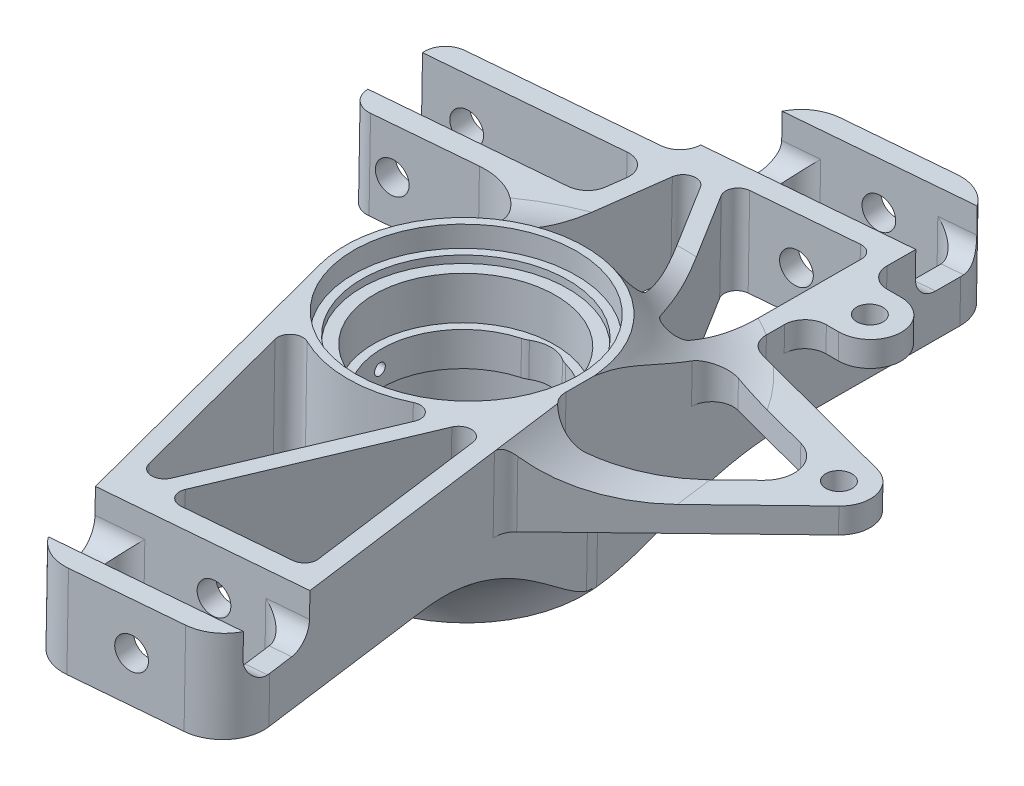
from build123d import *

# Parameters (mm, degrees)
EXTRUDE1_DEPTH               = 41.275
EXTRUDE1_DEPTH_BACK          = 22.224999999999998
SKETCH1_W                    = 279.4
SKETCH1_H                    = 274.177051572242
SKETCH3_R                    = 4.000500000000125
CUT_EXTRUDE1_DEPTH           = 417.6308239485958
CUT_EXTRUDE2_DEPTH           = 417.6308239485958
CUT_EXTRUDE3_DEPTH           = 393.83917714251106
CUT_EXTRUDE4_DEPTH           = 393.83917714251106
CUT_EXTRUDE9_DEPTH           = 393.83917714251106
CUT_EXTRUDE10_REACH          = 680.719
SKETCH13_R                   = 4.762500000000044
CUT_EXTRUDE11_REACH          = 681.051
SKETCH14_R                   = 4.762500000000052
CUT_EXTRUDE12_DEPTH          = 731.3953390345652
CUT_EXTRUDE12_DEPTH_BACK     = 731.3953390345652
CUT_EXTRUDE13_DEPTH          = 731.3953390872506
CUT_EXTRUDE13_DEPTH_BACK     = 731.3953390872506
CUT_EXTRUDE15_DEPTH          = 33.654999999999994
CUT_EXTRUDE16_DEPTH          = 393.8391772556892
SKETCH21_R                   = 4.762500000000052
CUT_EXTRUDE17_DEPTH          = 668.433488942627
CUT_REVOLVE3_ANGLE           = 93.00000000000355
CUT_REVOLVE3_OTHER_WAY_ANGLE = 86.0000000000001
CUT_REVOLVE4_ANGLE           = 95.00000000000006
CUT_REVOLVE4_OTHER_WAY_ANGLE = 87.00000000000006
CUT_EXTRUDE19_DEPTH          = 6.985
CUT_EXTRUDE18_DEPTH          = 388.7974686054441
SKETCH28_R                   = 9.52499999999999
CUT_EXTRUDE20_DEPTH          = 391.6164423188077
FILLET1_R                    = 6.35
SKETCH29_R                   = 1.727199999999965
CUT_EXTRUDE21_DEPTH          = 729.2649900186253


with BuildPart() as part:
    # Sketch1 → Extrude1 (new, two sides: drawn at the far end of the back side and taken through both)
    with BuildSketch(Plane(origin=(0, -592.2859892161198, 10.338390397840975), x_dir=(1, 0, -1.1e-16), z_dir=(0, 0.9998476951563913, -0.017452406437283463)).offset(-EXTRUDE1_DEPTH_BACK)):
        with Locations((12.699999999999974, -244.32882536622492)):
            Rectangle(SKETCH1_W, SKETCH1_H)
    extrude(amount=EXTRUDE1_DEPTH + EXTRUDE1_DEPTH_BACK)

    # Sketch2 → Cut-Revolve1 (revolve, cut)
    with BuildSketch(Plane(origin=(0, 0, 0), x_dir=(0, 0, -1), z_dir=(1, 0, 0)), mode=Mode.PRIVATE) as cut_revolve1_sk:
        Polygon((-219.7355249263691, -560.6866925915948), (-222.27513807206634, -560.642363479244), (-222.3141973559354, -562.8800683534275), (-226.05568242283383, -562.8147604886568), (-226.28259781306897, -575.8147344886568), (-228.8222109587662, -575.7704053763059), (-229.00196550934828, -586.0685366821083), (-226.46235236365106, -586.1128657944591), (-226.68926775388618, -599.112839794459), (-222.94778268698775, -599.1781476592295), (-223.03981526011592, -604.4506902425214), (-220.50020211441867, -604.4950193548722), (-220.6110248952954, -610.8440522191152), (-254.3878797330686, -610.2544750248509), (-253.27965192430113, -546.7641463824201), (-219.50279708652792, -547.3537235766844), align=None)
    revolve(cut_revolve1_sk.sketch.rotate(Axis((0, -489.9527519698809, 252.2880053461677), (0, -0.9998476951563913, 0.01745240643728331)), 180), axis=Axis((0, -489.9527519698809, 252.2880053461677), (0, -0.9998476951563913, 0.01745240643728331)), mode=Mode.SUBTRACT)

    # Sketch3 → Cut-Extrude1 (cut, through all)
    with BuildSketch(Plane(origin=(1.07e-15, -614.5076042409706, 10.72627013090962), x_dir=(1, 0, 0), z_dir=(0, -0.9998476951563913, 0.01745240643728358))):
        with Locations(Location((45.639472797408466, 165.56405915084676, 0), (0, 0, 270))):
            Circle(SKETCH3_R)
        with Locations(Location((85.91621696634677, 215.30169599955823, 0), (0, 0, 270))):
            Circle(SKETCH3_R)
    extrude(amount=-CUT_EXTRUDE1_DEPTH, mode=Mode.SUBTRACT)

    # Sketch4 → Cut-Extrude2 (cut, through all)
    with BuildSketch(Plane(origin=(1.07e-15, -614.5076042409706, 10.72627013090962), x_dir=(1, 0, 0), z_dir=(0, -0.9998476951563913, 0.01745240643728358))):
        Polygon((152.4, 381.417351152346), (-126.99999999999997, 381.417351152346), (-127.00000000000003, 107.24029958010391), (152.39999999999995, 107.2402995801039), align=None)
        with BuildLine():
            ThreePointArc((-4.192094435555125, 365.30740632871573), (0.80575422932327, 372.3659101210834), (9.164315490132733, 374.5874908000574))
            Line((9.164315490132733, 374.5874908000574), (42.118284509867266, 371.69093175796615))
            ThreePointArc((42.118284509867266, 371.69093175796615), (50.97764534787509, 366.9049387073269), (53.568565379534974, 357.17451542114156))
            Line((53.568565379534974, 357.17451542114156), (41.620054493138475, 276.699951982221))
            ThreePointArc((41.620054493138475, 276.699951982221), (41.8715579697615, 273.7758881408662), (43.41106991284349, 271.2772272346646))
            Line((43.41106991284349, 271.2772272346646), (92.6514090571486, 222.03688809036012))
            ThreePointArc((92.6514090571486, 222.03688809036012), (95.11666046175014, 212.83644459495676), (88.3814683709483, 206.10125250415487))
            Line((88.3814683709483, 206.10125250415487), (40.29497767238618, 193.2165161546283))
            ThreePointArc((40.29497767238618, 193.2165161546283), (36.925955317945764, 190.9812342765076), (35.589016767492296, 187.1655571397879))
            Line((35.58901676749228, 187.1655571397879), (35.515534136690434, 181.52172913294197))
            ThreePointArc((35.51553413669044, 181.52172913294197), (37.34573418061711, 176.97825509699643), (41.864995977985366, 175.08905915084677))
            Line((41.864995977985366, 175.08905915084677), (45.639472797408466, 175.08905915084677))
            ThreePointArc((45.639472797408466, 175.08905915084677), (55.1644727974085, 165.56405915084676), (45.639472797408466, 156.03905915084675))
            Line((45.639472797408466, 156.03905915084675), (41.45161103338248, 156.03905915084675))
            ThreePointArc((41.45161103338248, 156.03905915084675), (36.9908069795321, 154.20832094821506), (35.102149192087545, 149.77172913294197))
            Line((35.10214919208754, 149.77172913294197), (34.80159010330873, 126.68731061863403))
            ThreePointArc((34.80159010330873, 126.68731061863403), (30.61961912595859, 117.43184824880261), (20.990660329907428, 114.20142762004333))
            Line((20.990660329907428, 114.20142762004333), (-11.963308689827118, 117.09798666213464))
            ThreePointArc((-11.963308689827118, 117.09798666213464), (-19.717480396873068, 120.65630627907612), (-23.47042080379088, 128.31817652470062))
            Line((-23.470420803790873, 128.31817652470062), (-25.58256783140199, 146.94348505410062))
            ThreePointArc((-25.582567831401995, 146.94348505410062), (-27.45903803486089, 150.77442017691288), (-31.336123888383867, 152.55357998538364))
            Line((-31.336123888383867, 152.55357998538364), (-86.45561909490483, 157.39842499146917))
            ThreePointArc((-86.45561909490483, 157.39842499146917), (-90.76565234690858, 159.64430722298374), (-92.22522753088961, 164.28003951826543))
            Line((-92.22522753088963, 164.28003951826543), (-90.55721839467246, 183.2568739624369))
            ThreePointArc((-90.55721839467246, 183.2568739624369), (-88.3113361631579, 187.56690721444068), (-83.6756038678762, 189.02648239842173))
            Line((-83.6756038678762, 189.02648239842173), (-53.0416331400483, 186.33384452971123))
            ThreePointArc((-53.0416331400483, 186.33384452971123), (-37.73426898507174, 192.01141227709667), (-32.44494669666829, 207.45722862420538))
            Line((-32.444946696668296, 207.45722862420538), (-36.09067806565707, 239.60597143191))
            ThreePointArc((-36.09067806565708, 239.60597143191), (-36.2119253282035, 246.52434957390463), (-35.0189949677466, 253.34018218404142))
            Line((-35.0189949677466, 253.34018218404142), (-4.192094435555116, 365.30740632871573))
        make_face(mode=Mode.SUBTRACT)
    extrude(amount=-CUT_EXTRUDE2_DEPTH, mode=Mode.SUBTRACT)

    # Sketch5 → Cut-Extrude3 (cut, through all)
    with BuildSketch(Plane(origin=(1.07e-15, -614.5076042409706, 10.72627013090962), x_dir=(1, 0, 0), z_dir=(0, -0.9998476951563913, 0.01745240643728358))):
        with BuildLine():
            Line((8.608312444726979, 368.26187931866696), (41.56228146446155, 365.3653202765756))
            ThreePointArc((41.56228146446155, 365.3653202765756), (45.99196188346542, 362.97232375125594), (47.28742189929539, 358.10711210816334))
            Line((47.28742189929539, 358.10711210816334), (46.00561361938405, 349.4739893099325))
            ThreePointArc((46.00561361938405, 349.4739893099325), (43.65708509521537, 345.4209025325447), (39.168467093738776, 344.0809745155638))
            Line((39.168467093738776, 344.0809745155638), (5.145302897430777, 347.0715127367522))
            ThreePointArc((5.145302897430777, 347.0715127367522), (0.4864848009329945, 349.77384663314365), (-0.4208959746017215, 355.0826934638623))
            Line((-0.4208959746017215, 355.0826934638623), (1.9301074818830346, 363.621837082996))
            ThreePointArc((1.9301074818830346, 363.621837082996), (4.429031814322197, 367.1510889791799), (8.608312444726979, 368.26187931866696))
        make_face()
    extrude(amount=-CUT_EXTRUDE3_DEPTH, mode=Mode.SUBTRACT)

    # Sketch6 → Cut-Extrude4 (cut, through all)
    with BuildSketch(Plane(origin=(1.07e-15, -614.5076042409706, 10.72627013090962), x_dir=(1, 0, 0), z_dir=(0, -0.9998476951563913, 0.01745240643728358))):
        with BuildLine():
            Line((-11.407305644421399, 123.42359814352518), (21.546663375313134, 120.52703910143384))
            ThreePointArc((21.546663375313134, 120.52703910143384), (26.361142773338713, 122.1422494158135), (28.452128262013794, 126.7699806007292))
            Line((28.452128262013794, 126.7699806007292), (28.565868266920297, 135.50577323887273))
            ThreePointArc((28.565868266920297, 135.50577323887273), (26.92680759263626, 139.84691957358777), (22.772409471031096, 141.9140547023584))
            Line((22.772409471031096, 141.9140547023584), (-11.297074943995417, 144.9086643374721))
            ThreePointArc((-11.297074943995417, 144.9086643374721), (-16.399529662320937, 143.01614175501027), (-18.162637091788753, 137.86753630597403))
            Line((-18.162637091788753, 137.86753630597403), (-17.16086170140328, 129.03369307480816))
            ThreePointArc((-17.16086170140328, 129.03369307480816), (-15.28439149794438, 125.2027579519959), (-11.407305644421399, 123.42359814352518))
        make_face()
    extrude(amount=-CUT_EXTRUDE4_DEPTH, mode=Mode.SUBTRACT)

    # Sketch12 → Cut-Extrude9 (cut, through all)
    with BuildSketch(Plane(origin=(1.07e-15, -614.5076042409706, 10.72627013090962), x_dir=(1, 0, 0), z_dir=(0, -0.9998476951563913, 0.01745240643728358))):
        with BuildLine():
            Line((5.45259545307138, 335.12581291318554), (28.66940224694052, 276.76601119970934))
            ThreePointArc((28.66940224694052, 276.76601119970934), (32.64906074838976, 274.38979504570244), (35.97823718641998, 277.61480190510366))
            Line((35.97823718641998, 277.61480190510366), (44.23252897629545, 333.20838462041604))
            ThreePointArc((44.23252897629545, 333.20838462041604), (43.455252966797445, 336.12751160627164), (40.79744471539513, 337.5633095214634))
            Line((40.79744471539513, 337.5633095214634), (9.32634613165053, 340.3295285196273))
            ThreePointArc((9.32634613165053, 340.3295285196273), (5.936578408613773, 338.80923306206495), (5.45259545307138, 335.12581291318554))
        make_face()
        with BuildLine():
            Line((0.30729947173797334, 334.31657701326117), (21.524174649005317, 280.9839788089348))
            ThreePointArc((21.524174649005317, 280.9839788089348), (20.559752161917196, 276.76818753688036), (16.276681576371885, 276.1695949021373))
            ThreePointArc((16.276681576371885, 276.1695949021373), (0.03966217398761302, 280.02070444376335), (-16.20572901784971, 276.20506441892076))
            ThreePointArc((-16.20572901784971, 276.20506441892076), (-20.326399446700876, 276.67271575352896), (-21.578951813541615, 280.6261617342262))
            Line((-21.578951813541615, 280.6261617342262), (-6.9061705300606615, 333.9195698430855))
            ThreePointArc((-6.9061705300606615, 333.9195698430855), (-3.442223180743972, 336.7124710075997), (0.30729947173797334, 334.31657701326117))
        make_face()
        with BuildLine():
            Line((-14.200579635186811, 157.53637787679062), (14.422806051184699, 203.13442122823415))
            ThreePointArc((14.422806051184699, 203.13442122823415), (14.237075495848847, 207.45512845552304), (10.132999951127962, 208.8187892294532))
            ThreePointArc((10.132999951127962, 208.8187892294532), (-6.064401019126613, 207.88656720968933), (-21.051830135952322, 214.09960226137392))
            ThreePointArc((-21.051830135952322, 214.09960226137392), (-25.195165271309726, 214.27679286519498), (-27.045799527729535, 210.56548913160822))
            Line((-27.045799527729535, 210.56548913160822), (-21.213219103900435, 159.1327013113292))
            ThreePointArc((-21.213219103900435, 159.1327013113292), (-18.273140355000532, 155.84704627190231), (-14.200579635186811, 157.53637787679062))
        make_face()
        with BuildLine():
            Line((-8.772873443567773, 156.62796415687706), (23.0728543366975, 207.3593099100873))
            ThreePointArc((23.0728543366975, 207.3593099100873), (27.37751367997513, 208.98806342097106), (30.109435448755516, 205.28407455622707))
            Line((30.109435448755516, 205.28407455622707), (29.413265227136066, 151.8147723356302))
            ThreePointArc((29.413265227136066, 151.8147723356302), (28.15867393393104, 149.03813362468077), (25.269986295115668, 148.06900743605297))
            Line((25.269986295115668, 148.06900743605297), (-5.879571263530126, 150.8069639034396))
            ThreePointArc((-5.879571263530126, 150.8069639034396), (-8.957759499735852, 152.9065157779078), (-8.772873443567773, 156.62796415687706))
        make_face()
    extrude(amount=-CUT_EXTRUDE9_DEPTH, mode=Mode.SUBTRACT)

    # Cut-Extrude10: up to this face of the body (flat: up to its plane)
    cut_extrude10_end = Plane(part.part.faces().sort_by_distance((25.061895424, -576.847009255, 349.066952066))[0])
    # Sketch13 → Cut-Extrude10 (cut, up to the picked face)
    with BuildSketch(Plane(origin=(32.74299583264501, 6.501283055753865, 372.45825681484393), x_dir=(0.9961592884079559, -0.0015281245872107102, -0.08754619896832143), z_dir=(0.08755953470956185, 0.017385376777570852, 0.9960075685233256)), mode=Mode.PRIVATE) as cut_extrude10_sk1:
        with Locations(Location((-5.629894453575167, -572.2633179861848, 0), (0, 0, 0.087568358))):
            Circle(SKETCH13_R)
    cut_extrude10_tool1 = split(extrude(cut_extrude10_sk1.sketch, amount=-CUT_EXTRUDE10_REACH, mode=Mode.PRIVATE), bisect_by=cut_extrude10_end, keep=Keep.BOTH, mode=Mode.PRIVATE)
    add(cut_extrude10_tool1.solids().sort_by(Axis((27.134724, -565.666273, 382.938505), (-0.08755953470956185, -0.017385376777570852, -0.9960075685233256)))[0], mode=Mode.SUBTRACT)

    # Cut-Extrude11: up to this face of the body (flat: up to its plane)
    cut_extrude11_end = Plane(part.part.faces().sort_by_distance((9.695207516, -580.154387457, 159.587381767))[0])
    # Sketch14 → Cut-Extrude11 (cut, up to the picked face)
    with BuildSketch(Plane(origin=(10.12194747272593, 2.009762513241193, 115.13921727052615), x_dir=(-0.9961592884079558, 0.0015281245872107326, 0.08754619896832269), z_dir=(-0.0875595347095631, -0.01738537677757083, -0.9960075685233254)), mode=Mode.PRIVATE) as cut_extrude11_sk1:
        with Locations(Location((5.629894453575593, -587.5924455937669, 0), (0, 0, 359.912431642))):
            Circle(SKETCH14_R)
    cut_extrude11_tool1 = split(extrude(cut_extrude11_sk1.sketch, amount=-CUT_EXTRUDE11_REACH, mode=Mode.PRIVATE), bisect_by=cut_extrude11_end, keep=Keep.BOTH, mode=Mode.PRIVATE)
    add(cut_extrude11_tool1.solids().sort_by(Axis((4.513676, -585.484587, 125.886995), (0.0875595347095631, 0.01738537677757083, 0.9960075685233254)))[0], mode=Mode.SUBTRACT)

    # Sketch15 → Cut-Extrude12 (cut, two sides: drawn at the far end of the back side and taken through both)
    with BuildSketch(Plane(origin=(-5.608271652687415, 0.00860318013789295, 0.49287586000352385), x_dir=(0.08754609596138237, -0.00013429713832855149, 0.99616046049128), z_dir=(-0.996159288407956, 0.001528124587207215, 0.0875461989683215)).offset(-CUT_EXTRUDE12_DEPTH_BACK)):
        with BuildLine():
            Line((346.13350146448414, 6.201886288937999), (355.79101146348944, -544.9515083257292))
            Line((355.79101146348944, -544.9515083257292), (356.04606475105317, -559.5073809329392))
            ThreePointArc((356.04606475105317, -559.5073809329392), (357.9843168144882, -563.9642354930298), (362.50634007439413, -565.7451563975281))
            Line((362.50634007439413, -565.7451563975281), (371.2172029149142, -565.5925214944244))
            ThreePointArc((371.2172029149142, -565.5925214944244), (375.67405747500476, -563.6542694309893), (377.4549783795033, -559.1322461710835))
            Line((377.4549783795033, -559.1322461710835), (377.1999250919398, -544.5763735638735))
            Line((377.1999250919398, -544.5763735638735), (367.54241509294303, 6.57702105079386))
            Line((367.54241509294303, 6.57702105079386), (348.22739509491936, 1108.8838102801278))
            Line((348.22739509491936, 1108.8838102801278), (326.81848146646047, 1108.508675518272))
            Line((326.81848146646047, 1108.508675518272), (346.13350146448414, 6.201886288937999))
        make_face()
    extrude(amount=CUT_EXTRUDE12_DEPTH + CUT_EXTRUDE12_DEPTH_BACK, mode=Mode.SUBTRACT)

    # Sketch16 → Cut-Extrude13 (cut, two sides: drawn at the far end of the back side and taken through both)
    with BuildSketch(Plane(origin=(-5.608271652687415, 0.00860318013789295, 0.49287586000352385), x_dir=(0.08754609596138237, -0.00013429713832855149, 0.99616046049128), z_dir=(-0.996159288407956, 0.001528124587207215, 0.0875461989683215)).offset(-CUT_EXTRUDE13_DEPTH_BACK)):
        with BuildLine():
            Line((122.01100543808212, -2.37068965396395), (131.5871416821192, -548.8800899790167))
            Line((131.5871416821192, -548.8800899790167), (132.11075628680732, -578.7627374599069))
            ThreePointArc((132.11075628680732, -578.7627374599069), (134.04900835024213, -583.2195920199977), (138.5710316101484, -585.0005129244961))
            Line((138.5710316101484, -585.0005129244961), (147.28189445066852, -584.8478780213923))
            ThreePointArc((147.28189445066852, -584.8478780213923), (151.73874901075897, -582.9096259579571), (153.5196699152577, -578.3876026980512))
            Line((153.5196699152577, -578.3876026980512), (152.9960553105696, -548.5049552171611))
            Line((152.9960553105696, -548.5049552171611), (143.4199190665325, -1.9955548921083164))
            Line((143.4199190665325, -1.9955548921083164), (124.26764657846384, 1091.0232457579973))
            Line((124.26764657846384, 1091.0232457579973), (102.85873295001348, 1090.6481109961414))
            Line((102.85873295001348, 1090.6481109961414), (122.01100543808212, -2.37068965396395))
        make_face()
    extrude(amount=CUT_EXTRUDE13_DEPTH + CUT_EXTRUDE13_DEPTH_BACK, mode=Mode.SUBTRACT)

    # Sketch19 → Cut-Extrude15 (cut)
    with BuildSketch(Plane(origin=(1.07e-15, -614.5076042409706, 10.72627013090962), x_dir=(1, 0, 0), z_dir=(0, -0.9998476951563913, 0.01745240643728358))):
        with BuildLine():
            Line((34.416970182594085, 97.14660614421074), (36.264849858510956, 239.07286755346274))
            ThreePointArc((36.264849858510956, 239.07286755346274), (36.344358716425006, 240.7773129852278), (36.53812330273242, 242.4725743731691))
            Line((36.53812330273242, 242.4725743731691), (44.4581119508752, 295.81458786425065))
            Line((44.4581119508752, 295.81458786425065), (153.83038155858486, 292.27043398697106))
            Line((153.83038155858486, 292.27043398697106), (115.55908784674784, 97.14660614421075))
            Line((115.55908784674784, 97.14660614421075), (34.416970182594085, 97.14660614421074))
        make_face()
    extrude(amount=-CUT_EXTRUDE15_DEPTH, mode=Mode.SUBTRACT)

    # Sketch20 → Cut-Extrude16 (cut, through all)
    with BuildSketch(Plane(origin=(1.07e-15, -614.5076042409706, 10.72627013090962), x_dir=(1, 0, 0), z_dir=(0, -0.9998476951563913, 0.01745240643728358))):
        with BuildLine():
            Line((-115.51139015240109, 185.13154971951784), (-34.22024399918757, 177.98629191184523))
            ThreePointArc((-34.22024399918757, 177.98629191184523), (-30.34315814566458, 176.20713210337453), (-28.466687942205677, 172.37619698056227))
            Line((-28.466687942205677, 172.37619698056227), (-27.809546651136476, 166.58140185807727))
            ThreePointArc((-27.809546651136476, 166.58140185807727), (-29.572654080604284, 161.43279640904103), (-34.6751087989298, 159.5402738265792))
            Line((-34.6751087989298, 159.5402738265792), (-117.12379898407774, 166.78727642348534))
            Line((-117.12379898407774, 166.78727642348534), (-115.51139015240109, 185.13154971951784))
        make_face()
    extrude(amount=-CUT_EXTRUDE16_DEPTH, mode=Mode.SUBTRACT)

    # Sketch21 → Cut-Extrude17 (cut, through all)
    with BuildSketch(Plane(origin=(13.065974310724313, 2.5943135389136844, 148.62812310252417), x_dir=(-0.9961592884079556, 0.001528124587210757, 0.08754619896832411), z_dir=(-0.08755953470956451, -0.017385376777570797, -0.9960075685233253))):
        with Locations(Location((93.55530085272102, -587.3027195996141, 0), (0, 0, 359.912431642))):
            Circle(SKETCH21_R)
    extrude(amount=-CUT_EXTRUDE17_DEPTH, mode=Mode.SUBTRACT)

    # Sketch22 → Cut-Revolve3 (revolve, cut)
    with BuildSketch(Plane(origin=(0, 0, 0), x_dir=(0, 0, -1), z_dir=(1, 0, 0))):
        with BuildLine():
            Line((-107.74609680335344, -598.5031718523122), (-107.74609680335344, -612.8141168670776))
            Line((-107.74609680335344, -612.8141168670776), (-218.07141174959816, -610.8883813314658))
            ThreePointArc((-218.07141174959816, -610.8883813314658), (-201.61152310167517, -600.5781851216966), (-182.48545641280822, -597.1985914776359))
            Line((-182.48545641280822, -597.1985914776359), (-107.74609680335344, -598.5031718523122))
        make_face()
    revolve(axis=Axis((0, -628.3460843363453, 254.7036699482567), (0, 0.9998476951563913, -0.017452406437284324)), revolution_arc=CUT_REVOLVE3_ANGLE, mode=Mode.SUBTRACT)

    # Sketch22 → Cut-Revolve3 other way (revolve, cut)
    with BuildSketch(Plane(origin=(0, 0, 0), x_dir=(0, 0, -1), z_dir=(1, 0, 0))):
        with BuildLine():
            Line((-107.74609680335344, -598.5031718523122), (-107.74609680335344, -612.8141168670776))
            Line((-107.74609680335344, -612.8141168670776), (-218.07141174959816, -610.8883813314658))
            ThreePointArc((-218.07141174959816, -610.8883813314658), (-201.61152310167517, -600.5781851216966), (-182.48545641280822, -597.1985914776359))
            Line((-182.48545641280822, -597.1985914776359), (-107.74609680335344, -598.5031718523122))
        make_face()
    revolve(axis=Axis((0, -628.3460843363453, 254.7036699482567), (0, -0.9998476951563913, 0.017452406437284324)), revolution_arc=CUT_REVOLVE3_OTHER_WAY_ANGLE, mode=Mode.SUBTRACT)

    # Sketch23 → Cut-Revolve4 (revolve, cut)
    with BuildSketch(Plane(origin=(0, 0, 0), x_dir=(0, 0, -1), z_dir=(1, 0, 0))):
        with BuildLine():
            Line((-327.09019302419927, -580.406098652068), (-409.0986152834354, -578.9746363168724))
            Line((-409.0986152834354, -578.9746363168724), (-409.59731779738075, -607.5452842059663))
            Line((-409.59731779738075, -607.5452842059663), (-290.7043477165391, -609.6205687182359))
            ThreePointArc((-290.7043477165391, -609.6205687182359), (-303.9016147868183, -588.7913775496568), (-327.09019302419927, -580.406098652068))
        make_face()
    revolve(axis=Axis((0, -628.3460843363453, 254.7036699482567), (0, 0.9998476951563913, -0.017452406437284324)), revolution_arc=CUT_REVOLVE4_ANGLE, mode=Mode.SUBTRACT)

    # Sketch23 → Cut-Revolve4 other way (revolve, cut)
    with BuildSketch(Plane(origin=(0, 0, 0), x_dir=(0, 0, -1), z_dir=(1, 0, 0))):
        with BuildLine():
            Line((-327.09019302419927, -580.406098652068), (-409.0986152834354, -578.9746363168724))
            Line((-409.0986152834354, -578.9746363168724), (-409.59731779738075, -607.5452842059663))
            Line((-409.59731779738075, -607.5452842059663), (-290.7043477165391, -609.6205687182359))
            ThreePointArc((-290.7043477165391, -609.6205687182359), (-303.9016147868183, -588.7913775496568), (-327.09019302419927, -580.406098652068))
        make_face()
    revolve(axis=Axis((0, -628.3460843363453, 254.7036699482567), (0, -0.9998476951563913, 0.017452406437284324)), revolution_arc=CUT_REVOLVE4_OTHER_WAY_ANGLE, mode=Mode.SUBTRACT)

    # Sketch27 → Cut-Extrude19 (cut)
    with BuildSketch(Plane(origin=(9.6e-16, -551.0172755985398, 9.618042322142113), x_dir=(1, 0, 0), z_dir=(0, 0.9998476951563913, -0.01745240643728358))):
        Polygon((163.51983667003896, -407.004109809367), (-88.84238892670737, -418.0618533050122), (-144.17346225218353, -68.86033809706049), (25.3441574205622, -61.432592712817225), (161.27048961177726, -143.45893461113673), align=None)
    extrude(amount=-CUT_EXTRUDE19_DEPTH, mode=Mode.SUBTRACT)

    # Cut-Sweep1: sweep along a path in Sketch24
    with BuildLine(Plane(origin=(-1.508e-14, -558.0012117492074, 9.739947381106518), x_dir=(1, 3.7e-16, -1e-17), z_dir=(0, 0.9998476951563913, -0.01745240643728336))) as cut_sweep1_path:
        Line((51.46402952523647, -343.0002299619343), (35.92814070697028, -238.3642730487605))
        ThreePointArc((35.92814070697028, -238.3642730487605), (-7.501739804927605, -208.1598518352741), (-35.01899496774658, -253.34018218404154))
        Line((-35.01899496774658, -253.34018218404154), (-8.873559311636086, -348.30373038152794))
    # Sketch25 → Cut-Sweep1 (sweep, cut)
    with BuildSketch(Plane(origin=(30.312150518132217, 6.01862674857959, 344.8068954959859), x_dir=(0.9961592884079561, -0.001528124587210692, -0.08754619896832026), z_dir=(0.08755953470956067, 0.017385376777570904, 0.9960075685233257))):
        with BuildLine():
            Line((304.75623956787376, -558.086210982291), (21.233430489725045, -558.0862109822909))
            ThreePointArc((21.233430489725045, -558.0862109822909), (34.67459250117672, -569.3038869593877), (51.71343048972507, -573.3262109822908))
            Line((51.71343048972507, -573.3262109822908), (304.75623956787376, -573.3262109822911))
            Line((304.75623956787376, -573.3262109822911), (304.75623956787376, -558.086210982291))
        make_face()
    sweep(path=cut_sweep1_path.line, mode=Mode.SUBTRACT)

    # Sketch26 → Cut-Extrude18 (cut, through all)
    with BuildSketch(Plane(origin=(1.01e-15, -580.8577300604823, 10.13890939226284), x_dir=(1, 0, 0), z_dir=(0, -0.9998476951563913, 0.01745240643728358))):
        with BuildLine():
            Line((47.24110395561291, 253.97680901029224), (74.25052206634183, 226.96739089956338))
            ThreePointArc((74.25052206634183, 226.96739089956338), (76.71577347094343, 217.76694740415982), (69.98058138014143, 211.0317553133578))
            Line((69.98058138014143, 211.0317553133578), (43.882605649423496, 204.0388237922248))
            ThreePointArc((43.882605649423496, 204.0388237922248), (38.3407575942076, 205.15992949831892), (35.88964287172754, 210.25512277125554))
            Line((35.88964287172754, 210.25512277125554), (36.40151405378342, 249.5693509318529))
            ThreePointArc((36.40151405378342, 249.5693509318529), (40.35917694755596, 255.369010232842), (47.24110395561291, 253.97680901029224))
        make_face()
    extrude(amount=-CUT_EXTRUDE18_DEPTH, mode=Mode.SUBTRACT)

    # Sketch28 → Cut-Extrude20 (cut, through all)
    with BuildSketch(Plane(origin=(-1.508e-14, -558.0012117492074, 9.739947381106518), x_dir=(1, -3e-17, 0), z_dir=(0, 0.9998476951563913, -0.017452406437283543))):
        with Locations((0, -226.99378109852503)):
            Circle(SKETCH28_R)
        with Locations((0, -260.4036710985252)):
            Circle(SKETCH28_R)
    extrude(amount=-CUT_EXTRUDE20_DEPTH, mode=Mode.SUBTRACT)

    # Fillet1
    fillet1_edges = [part.edges().sort_by_distance(p)[0] for p in [
        (5.769085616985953, -580.0600443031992, 278.14861239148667),
        (-5.769085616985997, -580.0600443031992, 278.1486123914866),
        (-5.769085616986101, -580.9076755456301, 229.58785103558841),
        (5.769085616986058, -580.9076755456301, 229.5878510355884),
    ]]
    fillet(fillet1_edges, radius=FILLET1_R)

    # Sketch29 → Cut-Extrude21 (cut, through all)
    with BuildSketch(Plane(origin=(0, 0, 0), x_dir=(0, 0, -1), z_dir=(1, 0, 0))):
        with Locations((-254.9283691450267, -580.4653551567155)):
            Circle(SKETCH29_R)
    extrude(amount=-CUT_EXTRUDE21_DEPTH, mode=Mode.SUBTRACT)


solid = part.part
